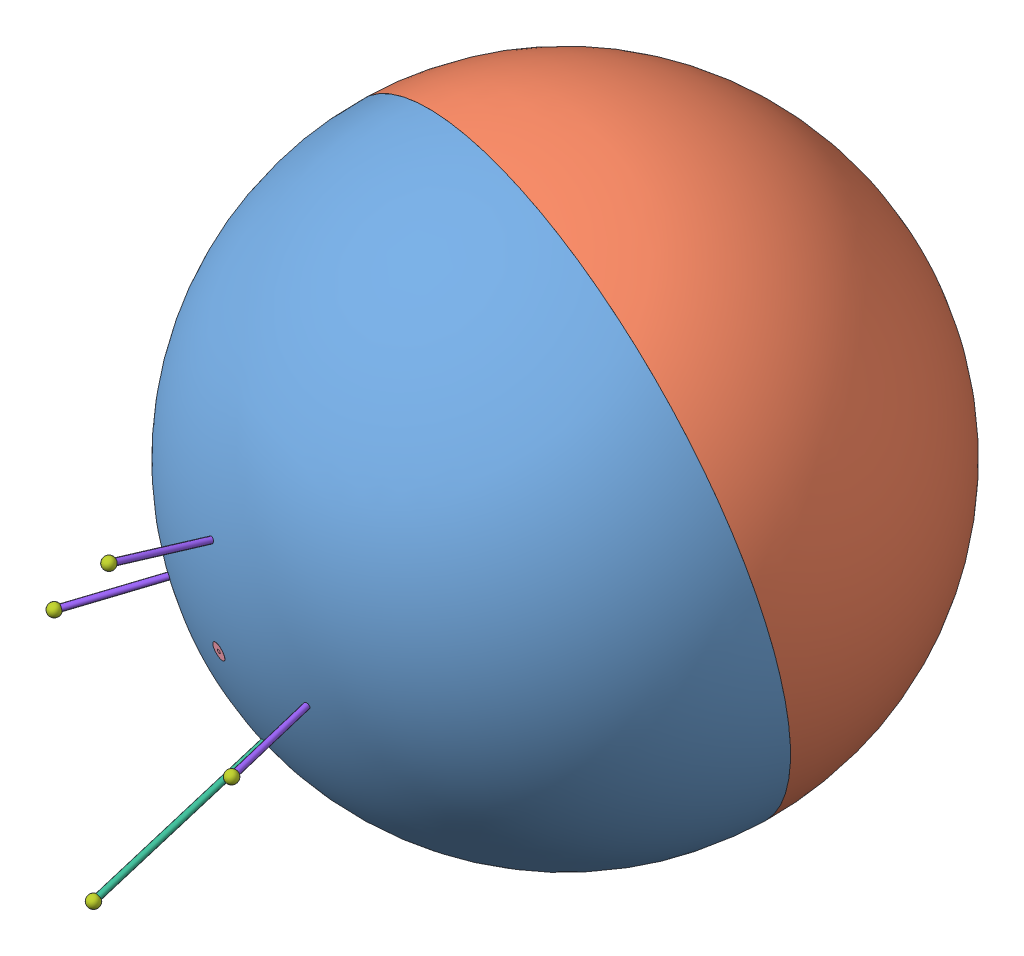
SolidWorks assembly Sphere_NoBallast.SLDASM, configuration Default (file format 13000). Lengths in mm.
Overall size (398.45 404.93 419.7).
18 component instances, 8 part files, 18 mates.
Components (placement in the parent):
- top-2: top.SLDPRT [Default] at (2.4591 -243.1851 143.5276) x (-0.074228 0.976404 0.202792) z (0.238083 0.214824 -0.947189) size (300 300 157.96)
- Bottom-4: Bottom.SLDPRT [Default] at (2.4591 -243.1851 143.5276) x (0.97089 -0.026267 0.238083) z (0.238083 0.214824 -0.947189) size (300 300 149.96)
- O_ring-1: O_ring.SLDPRT [Default] at (2.6258 -243.0347 142.8646) x (0.516921 0.797607 0.310831) z (-0.238083 -0.214824 0.947189) size (297 297 3)
- TopBotNut-1: TopBotNut.SLDPRT [Default] at (-30.6971 -273.1021 275.4362) x (0.97089 -0.026267 0.238083) z (-0.238083 -0.214824 0.947189) size (8 8 10.7)
- TopBotNut-3: TopBotNut.SLDPRT [Default] at (38.1629 -210.9694 1.4841) x (0.97089 -0.026267 0.238083) z (-0.238083 -0.214824 0.947189) size (8 8 10.7)
- CentreRod-2: CentreRod.SLDPRT [Default] at (33.648 -215.0432 19.4459) x (0.97089 -0.026267 0.238083) z (-0.238083 -0.214824 0.947189) size (8 8 133.4)
- LongMarker_StickAndBall-1: LongMarker_StickAndBall.SLDASM [Default] at (-56.7956 -326.8426 221.2385) x (0.827194 -0.544271 -0.139707) z (-0.205156 -0.52399 0.826647) size (6 6 88)
  - LongmarkerStick-1: LongmarkerStick.SLDPRT [Default] at (14.7774 44.0534 29.7665) size (3 3 82.4)
  - MarkerBall-1: MarkerBall.SLDPRT [Default] at (14.7774 44.0534 114.7646) size (6 6 6)
- ShortMarker_StickAndBall-1: ShortMarker_StickAndBall.SLDASM [Default] at (22.791 -278.6949 324.8052) x (0.531804 0.838211 0.120778) z (0.087422 -0.196192 0.976661) size (6 6 46.4)
  - MarkerBall-1: MarkerBall.SLDPRT [Default] at (-2.4965 2.3943 7.6053) size (6 6 6)
  - ShortmarkerStick-1: ShortmarkerStick.SLDPRT [Default] at (-2.4965 2.3943 -35.7928) size (3 3 40.8)
- ShortMarker_StickAndBall-2: ShortMarker_StickAndBall.SLDASM [Default] at (-96.0477 -284.728 295.5194) x (0.837853 -0.062848 0.542265) z (-0.542265 -0.210181 0.813494) size (6 6 46.4)
  - MarkerBall-1: MarkerBall.SLDPRT [Default] at (-2.4965 2.3943 7.6053) size (6 6 6)
  - ShortmarkerStick-1: ShortmarkerStick.SLDPRT [Default] at (-2.4965 2.3943 -35.7928) size (3 3 40.8)
- ShortMarker_StickAndBall-3: ShortMarker_StickAndBall.SLDASM [Default] at (-41.47 -223.7905 323.0408) x (0.968322 0.014867 0.249261) z (-0.249261 0.116986 0.961344) size (6 6 46.4)
  - MarkerBall-1: MarkerBall.SLDPRT [Default] at (-2.4965 2.3943 7.6053) size (6 6 6)
  - ShortmarkerStick-1: ShortmarkerStick.SLDPRT [Default] at (-2.4965 2.3943 -35.7928) size (3 3 40.8)
Mates (geometry in assembly coordinates):
- Coincident2: coincident aligned: circle of top-2; circle of Bottom-4
- Tangent7: tangent anti-aligned: torus of O_ring-1; plane of Bottom-4 through (6.8047 -384.764 110.1869) normal (-0.238083 -0.214824 0.947189)
- Tangent8: tangent aligned: cylinder of Bottom-4 through (2.721 -242.9488 142.4857) axis (0.238083 0.214824 -0.947189) radius 148.5; torus of O_ring-1
- Concentric6: concentric aligned: cylinder of top-2 through (-31.3487 -273.6901 278.0285) axis (-0.238083 -0.214824 0.947189) radius 3.3235; circle of TopBotNut-1
- Coincident7: coincident anti-aligned: circle of top-2; plane of TopBotNut-1 through (-33.2446 -275.4007 285.5711) normal (-0.238083 -0.214824 0.947189)
- Concentric7: concentric aligned: circle of Bottom-4; circle of TopBotNut-3
- Coincident8: coincident anti-aligned: circle of Bottom-4; plane of TopBotNut-3 through (38.1629 -210.9694 1.4841) normal (0.238083 0.214824 -0.947189)
- Concentric14: concentric anti-aligned: cylinder of Bottom-4 through (32.3386 -216.2247 24.6554) axis (0.238083 0.214824 -0.947189) radius 3.3235; circle of CentreRod-2
- Coincident11: coincident anti-aligned: circle of Bottom-4; plane of CentreRod-2 through (33.648 -215.0432 19.4459) normal (0.238083 0.214824 -0.947189)
- Coincident14: coincident: point of top-2; point of LongMarker_StickAndBall-1/LongmarkerStick-1
- Tangent14: tangent: sphere of Bottom-4; circle of LongMarker_StickAndBall-1/LongmarkerStick-1
- Coincident17: coincident: point of top-2; point of ShortMarker_StickAndBall-1/ShortmarkerStick-1
- Tangent15: tangent: sphere of Bottom-4; circle of ShortMarker_StickAndBall-1/ShortmarkerStick-1
- Coincident18: coincident: point of top-2; point of ShortMarker_StickAndBall-2/ShortmarkerStick-1
- Concentric21: concentric: sphere of Bottom-4; cylinder of ShortMarker_StickAndBall-2/ShortmarkerStick-1 through (-101.0051 -283.2876 298.7422) axis (0.542265 0.210181 -0.813494) radius 1.5
- Coincident19: coincident: point of top-2; point of ShortMarker_StickAndBall-2/ShortmarkerStick-1
- Coincident20: coincident: point of top-2; point of ShortMarker_StickAndBall-3/ShortmarkerStick-1
- Concentric22: concentric: sphere of Bottom-4; cylinder of ShortMarker_StickAndBall-3/ShortmarkerStick-1 through (-45.0999 -220.8642 326.9521) axis (0.249261 -0.116986 -0.961344) radius 1.5
